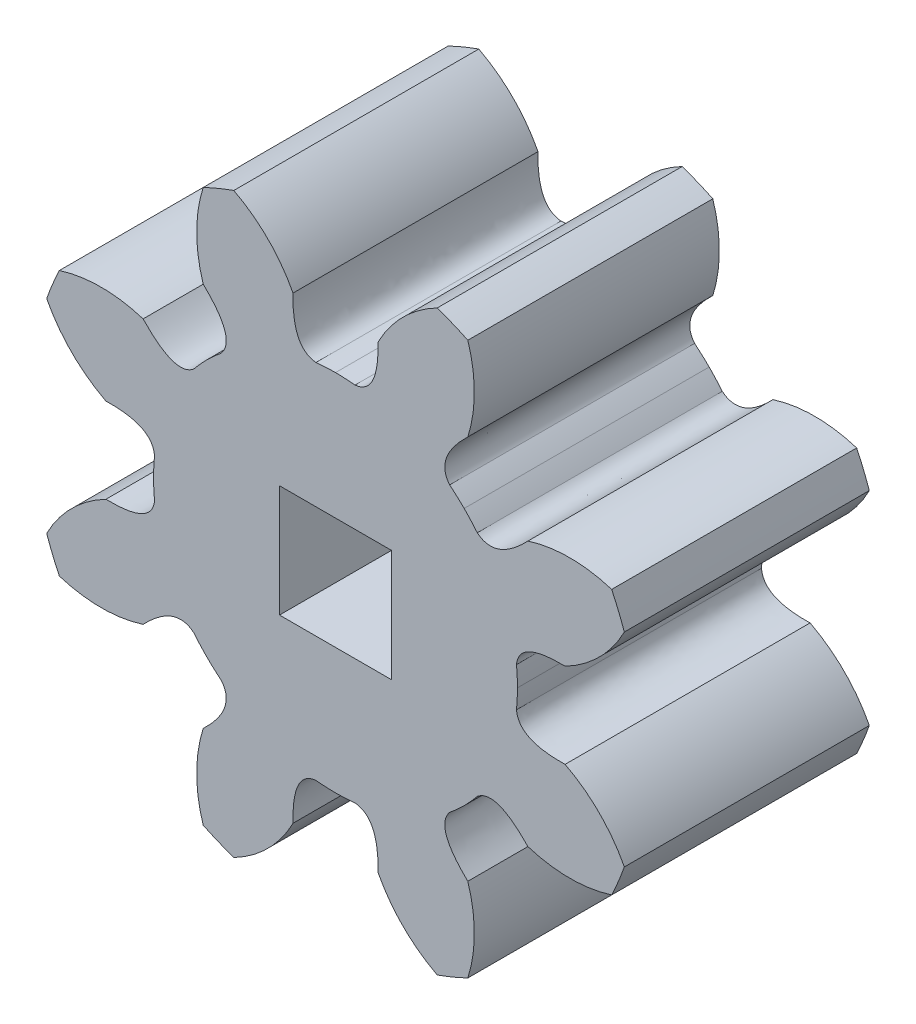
from build123d import *

# Parameters (mm, degrees)
SKETCH2_R           = 8.74991851
BOSS_EXTRUDE1_DEPTH = 7
CUT_EXTRUDE1_DEPTH  = 20.329278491
CIRPATTERN1_COUNT   = 8
SKETCH4_W           = 3.2
SKETCH4_H           = 3.2
CUT_EXTRUDE2_DEPTH  = 19.702124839


with BuildPart() as part:
    # Sketch2 → Boss-Extrude1 (new body)
    with BuildSketch(Plane.XY):
        with Locations((7, 0)):
            Circle(SKETCH2_R)
    extrude(amount=BOSS_EXTRUDE1_DEPTH)

    # Sketch3 → Cut-Extrude1 (cut, through all)
    with BuildSketch(Plane.XY):
        with BuildLine():
            ThreePointArc((3.017016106, 8.624722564), (4.639263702, 7.911644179), (5.78559, 6.56031))
            add(Edge.make_bspline(
                [(5.78559, 6.56031), (5.752049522, 5.236603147), (6.44191, 5.17086)],
                knots=[0, 0, 0, 1, 1, 1], degree=2))
            ThreePointArc((6.44191, 5.17086), (6.720644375, 5.191379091), (7, 5.2))
            ThreePointArc((7, 5.2), (7.279355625, 5.191379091), (7.55809, 5.17086))
            add(Edge.make_bspline(
                [(8.21441, 6.56031), (8.247950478, 5.236603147), (7.55809, 5.17086)],
                knots=[0, 0, 0, 1, 1, 1], degree=2))
            ThreePointArc((8.21441, 6.56031), (9.360736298, 7.911644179), (10.982983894, 8.624722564))
            ThreePointArc((10.982983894, 8.624722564), (7, 9.5), (3.017016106, 8.624722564))
        make_face()
    cut_extrude1 = extrude(amount=CUT_EXTRUDE1_DEPTH, mode=Mode.SUBTRACT)

    # CirPattern1: Cut-Extrude1 ×8 about axis
    cirpattern1_axis = Axis((7, 0, 7), (0, 0, 1))
    for i in range(1, CIRPATTERN1_COUNT):
        add(cut_extrude1.rotate(cirpattern1_axis, i * 360 / CIRPATTERN1_COUNT), mode=Mode.SUBTRACT)

    # Sketch4 → Cut-Extrude2 (cut, through all)
    with BuildSketch(Plane.XY.offset(7)):
        with Locations((7, 0)):
            Rectangle(SKETCH4_W, SKETCH4_H)
    extrude(amount=-CUT_EXTRUDE2_DEPTH, mode=Mode.SUBTRACT)


solid = part.part
